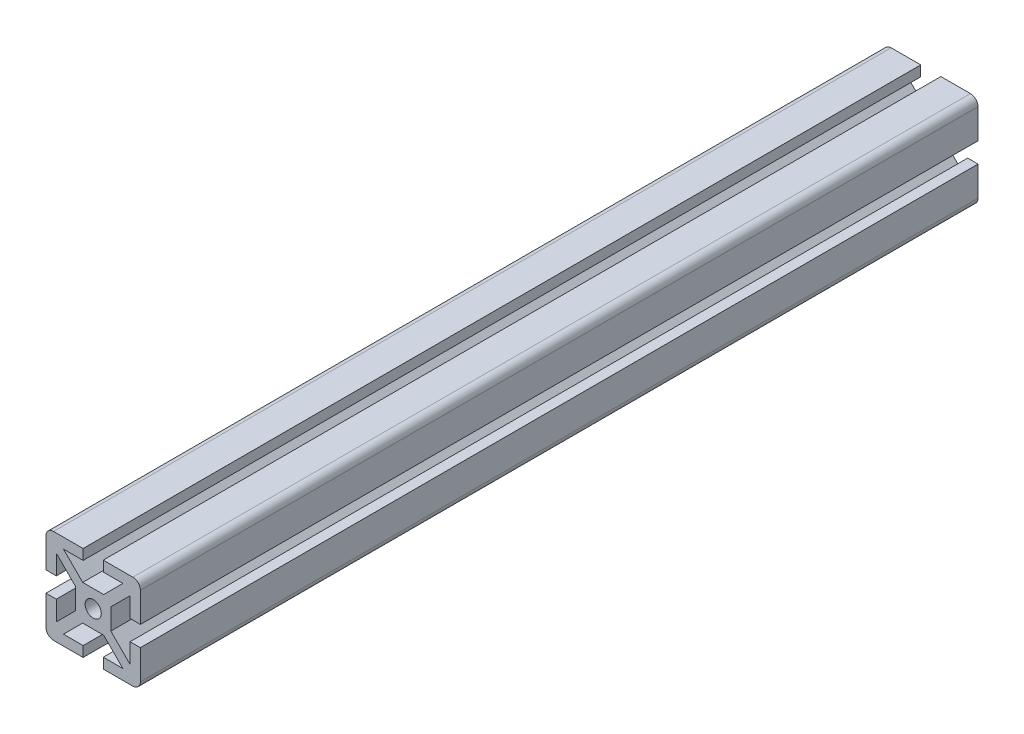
ISO-10303-21;
HEADER;
FILE_DESCRIPTION(('STEP AP214'),'2;1');
FILE_NAME('part.step','',(''),(''),'','','');
FILE_SCHEMA(('AUTOMOTIVE_DESIGN { 1 0 10303 214 1 1 1 1 }'));
ENDSEC;
DATA;
#1=APPLICATION_CONTEXT('core data for automotive mechanical design processes');
#2=APPLICATION_PROTOCOL_DEFINITION('international standard','automotive_design',2000,#1);
#3=PRODUCT_CONTEXT('',#1,'mechanical');
#4=PRODUCT('Part','Part','',(#3));
#5=PRODUCT_RELATED_PRODUCT_CATEGORY('part','',(#4));
#6=PRODUCT_DEFINITION_FORMATION('','',#4);
#7=PRODUCT_DEFINITION_CONTEXT('part definition',#1,'design');
#8=PRODUCT_DEFINITION('design','',#6,#7);
#9=PRODUCT_DEFINITION_SHAPE('','',#8);
#10=(LENGTH_UNIT() NAMED_UNIT(*) SI_UNIT(.MILLI.,.METRE.));
#11=(NAMED_UNIT(*) PLANE_ANGLE_UNIT() SI_UNIT($,.RADIAN.));
#12=(NAMED_UNIT(*) SI_UNIT($,.STERADIAN.) SOLID_ANGLE_UNIT());
#13=UNCERTAINTY_MEASURE_WITH_UNIT(LENGTH_MEASURE(1.E-05),#10,'distance_accuracy_value','');
#14=(GEOMETRIC_REPRESENTATION_CONTEXT(3) GLOBAL_UNCERTAINTY_ASSIGNED_CONTEXT((#13)) GLOBAL_UNIT_ASSIGNED_CONTEXT((#10,
#11,#12)) REPRESENTATION_CONTEXT('',''));
#15=CARTESIAN_POINT('',(0.,0.,0.));
#16=DIRECTION('',(0.,0.,1.));
#17=DIRECTION('',(1.,0.,0.));
#18=AXIS2_PLACEMENT_3D('',#15,#16,#17);
#19=CARTESIAN_POINT('',(-7.11199999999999,0.,-338.1375));
#20=DIRECTION('',(-1.,0.,0.));
#21=DIRECTION('',(0.,-1.,0.));
#22=AXIS2_PLACEMENT_3D('',#19,#20,#21);
#23=PLANE('',#22);
#24=DIRECTION('',(0.,-1.,0.));
#25=VECTOR('',#24,1.);
#26=CARTESIAN_POINT('',(-7.11199999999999,0.,0.));
#27=LINE('',#26,#25);
#28=CARTESIAN_POINT('',(-7.11199999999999,4.23831804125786,0.));
#29=VERTEX_POINT('',#28);
#30=CARTESIAN_POINT('',(-7.11199999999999,-4.23831804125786,0.));
#31=VERTEX_POINT('',#30);
#32=EDGE_CURVE('E438',#29,#31,#27,.T.);
#33=ORIENTED_EDGE('',*,*,#32,.F.);
#34=DIRECTION('',(0.,0.,1.));
#35=VECTOR('',#34,1.);
#36=CARTESIAN_POINT('',(-7.11199999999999,4.23831804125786,-338.1375));
#37=LINE('',#36,#35);
#38=CARTESIAN_POINT('',(-7.11199999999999,4.23831804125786,-338.1375));
#39=VERTEX_POINT('',#38);
#40=EDGE_CURVE('E11',#39,#29,#37,.T.);
#41=ORIENTED_EDGE('',*,*,#40,.F.);
#42=DIRECTION('',(0.,-1.,0.));
#43=VECTOR('',#42,1.);
#44=CARTESIAN_POINT('',(-7.11199999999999,0.,-338.1375));
#45=LINE('',#44,#43);
#46=CARTESIAN_POINT('',(-7.11199999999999,-4.23831804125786,-338.1375));
#47=VERTEX_POINT('',#46);
#48=EDGE_CURVE('E52',#39,#47,#45,.T.);
#49=ORIENTED_EDGE('',*,*,#48,.T.);
#50=DIRECTION('',(0.,0.,1.));
#51=VECTOR('',#50,1.);
#52=CARTESIAN_POINT('',(-7.11199999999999,-4.23831804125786,-338.1375));
#53=LINE('',#52,#51);
#54=EDGE_CURVE('E37',#47,#31,#53,.T.);
#55=ORIENTED_EDGE('',*,*,#54,.T.);
#56=EDGE_LOOP('',(#33,#41,#49,#55));
#57=FACE_BOUND('',#56,.T.);
#58=ADVANCED_FACE('F33',(#57),#23,.T.);
#59=CARTESIAN_POINT('',(-7.11199999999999,4.23831804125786,-338.1375));
#60=DIRECTION('',(-0.707106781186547,-0.707106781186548,0.));
#61=DIRECTION('',(0.707106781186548,-0.707106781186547,0.));
#62=AXIS2_PLACEMENT_3D('',#59,#60,#61);
#63=PLANE('',#62);
#64=DIRECTION('',(0.707106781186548,-0.707106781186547,0.));
#65=VECTOR('',#64,1.);
#66=CARTESIAN_POINT('',(-7.11199999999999,4.23831804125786,0.));
#67=LINE('',#66,#65);
#68=CARTESIAN_POINT('',(-14.8844,12.0107180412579,0.));
#69=VERTEX_POINT('',#68);
#70=EDGE_CURVE('E436',#69,#29,#67,.T.);
#71=ORIENTED_EDGE('',*,*,#70,.F.);
#72=DIRECTION('',(0.,0.,1.));
#73=VECTOR('',#72,1.);
#74=CARTESIAN_POINT('',(-14.8844,12.0107180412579,-338.1375));
#75=LINE('',#74,#73);
#76=CARTESIAN_POINT('',(-14.8844,12.0107180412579,-338.1375));
#77=VERTEX_POINT('',#76);
#78=EDGE_CURVE('E43',#77,#69,#75,.T.);
#79=ORIENTED_EDGE('',*,*,#78,.F.);
#80=DIRECTION('',(0.707106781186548,-0.707106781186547,0.));
#81=VECTOR('',#80,1.);
#82=CARTESIAN_POINT('',(-7.11199999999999,4.23831804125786,-338.1375));
#83=LINE('',#82,#81);
#84=EDGE_CURVE('E314',#77,#39,#83,.T.);
#85=ORIENTED_EDGE('',*,*,#84,.T.);
#86=ORIENTED_EDGE('',*,*,#40,.T.);
#87=EDGE_LOOP('',(#71,#79,#85,#86));
#88=FACE_BOUND('',#87,.T.);
#89=ADVANCED_FACE('F518',(#88),#63,.T.);
#90=CARTESIAN_POINT('',(-14.8844,12.0107180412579,-338.1375));
#91=DIRECTION('',(1.,0.,0.));
#92=DIRECTION('',(0.,1.,0.));
#93=AXIS2_PLACEMENT_3D('',#90,#91,#92);
#94=PLANE('',#93);
#95=DIRECTION('',(0.,1.,0.));
#96=VECTOR('',#95,1.);
#97=CARTESIAN_POINT('',(-14.8844,12.0107180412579,0.));
#98=LINE('',#97,#96);
#99=CARTESIAN_POINT('',(-14.8844,4.06400000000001,0.));
#100=VERTEX_POINT('',#99);
#101=EDGE_CURVE('E302',#100,#69,#98,.T.);
#102=ORIENTED_EDGE('',*,*,#101,.F.);
#103=DIRECTION('',(0.,0.,1.));
#104=VECTOR('',#103,1.);
#105=CARTESIAN_POINT('',(-14.8844,4.06400000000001,-338.1375));
#106=LINE('',#105,#104);
#107=CARTESIAN_POINT('',(-14.8844,4.06400000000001,-338.1375));
#108=VERTEX_POINT('',#107);
#109=EDGE_CURVE('E297',#108,#100,#106,.T.);
#110=ORIENTED_EDGE('',*,*,#109,.F.);
#111=DIRECTION('',(0.,1.,0.));
#112=VECTOR('',#111,1.);
#113=CARTESIAN_POINT('',(-14.8844,12.0107180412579,-338.1375));
#114=LINE('',#113,#112);
#115=EDGE_CURVE('E300',#108,#77,#114,.T.);
#116=ORIENTED_EDGE('',*,*,#115,.T.);
#117=ORIENTED_EDGE('',*,*,#78,.T.);
#118=EDGE_LOOP('',(#102,#110,#116,#117));
#119=FACE_BOUND('',#118,.T.);
#120=ADVANCED_FACE('F299',(#119),#94,.T.);
#121=CARTESIAN_POINT('',(-14.8844,4.06400000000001,-338.1375));
#122=DIRECTION('',(0.,-1.,0.));
#123=DIRECTION('',(1.,0.,0.));
#124=AXIS2_PLACEMENT_3D('',#121,#122,#123);
#125=PLANE('',#124);
#126=DIRECTION('',(1.,0.,0.));
#127=VECTOR('',#126,1.);
#128=CARTESIAN_POINT('',(-14.8844,4.06400000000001,0.));
#129=LINE('',#128,#127);
#130=CARTESIAN_POINT('',(-19.05,4.064,0.));
#131=VERTEX_POINT('',#130);
#132=EDGE_CURVE('E433',#131,#100,#129,.T.);
#133=ORIENTED_EDGE('',*,*,#132,.F.);
#134=DIRECTION('',(0.,0.,1.));
#135=VECTOR('',#134,1.);
#136=CARTESIAN_POINT('',(-19.05,4.064,-338.1375));
#137=LINE('',#136,#135);
#138=CARTESIAN_POINT('',(-19.05,4.064,-338.1375));
#139=VERTEX_POINT('',#138);
#140=EDGE_CURVE('E307',#139,#131,#137,.T.);
#141=ORIENTED_EDGE('',*,*,#140,.F.);
#142=DIRECTION('',(1.,0.,0.));
#143=VECTOR('',#142,1.);
#144=CARTESIAN_POINT('',(-14.8844,4.06400000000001,-338.1375));
#145=LINE('',#144,#143);
#146=EDGE_CURVE('E312',#139,#108,#145,.T.);
#147=ORIENTED_EDGE('',*,*,#146,.T.);
#148=ORIENTED_EDGE('',*,*,#109,.T.);
#149=EDGE_LOOP('',(#133,#141,#147,#148));
#150=FACE_BOUND('',#149,.T.);
#151=ADVANCED_FACE('F316',(#150),#125,.T.);
#152=CARTESIAN_POINT('',(-19.05,4.064,-338.1375));
#153=DIRECTION('',(-1.,0.,0.));
#154=DIRECTION('',(0.,-1.,0.));
#155=AXIS2_PLACEMENT_3D('',#152,#153,#154);
#156=PLANE('',#155);
#157=DIRECTION('',(0.,-1.,0.));
#158=VECTOR('',#157,1.);
#159=CARTESIAN_POINT('',(-19.05,4.064,0.));
#160=LINE('',#159,#158);
#161=CARTESIAN_POINT('',(-19.05,16.002,0.));
#162=VERTEX_POINT('',#161);
#163=EDGE_CURVE('E430',#162,#131,#160,.T.);
#164=ORIENTED_EDGE('',*,*,#163,.F.);
#165=DIRECTION('',(0.,0.,1.));
#166=VECTOR('',#165,1.);
#167=CARTESIAN_POINT('',(-19.05,16.002,-338.1375));
#168=LINE('',#167,#166);
#169=CARTESIAN_POINT('',(-19.05,16.002,-338.1375));
#170=VERTEX_POINT('',#169);
#171=EDGE_CURVE('E442',#170,#162,#168,.T.);
#172=ORIENTED_EDGE('',*,*,#171,.F.);
#173=DIRECTION('',(0.,-1.,0.));
#174=VECTOR('',#173,1.);
#175=CARTESIAN_POINT('',(-19.05,4.064,-338.1375));
#176=LINE('',#175,#174);
#177=EDGE_CURVE('E317',#170,#139,#176,.T.);
#178=ORIENTED_EDGE('',*,*,#177,.T.);
#179=ORIENTED_EDGE('',*,*,#140,.T.);
#180=EDGE_LOOP('',(#164,#172,#178,#179));
#181=FACE_BOUND('',#180,.T.);
#182=ADVANCED_FACE('F531',(#181),#156,.T.);
#183=CARTESIAN_POINT('',(-16.002,16.002,-338.1375));
#184=DIRECTION('',(0.,0.,1.));
#185=DIRECTION('',(1.,0.,0.));
#186=AXIS2_PLACEMENT_3D('',#183,#184,#185);
#187=CYLINDRICAL_SURFACE('',#186,3.04800000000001);
#188=CARTESIAN_POINT('',(-16.002,16.002,0.));
#189=DIRECTION('',(0.,0.,1.));
#190=DIRECTION('',(1.,0.,0.));
#191=AXIS2_PLACEMENT_3D('',#188,#189,#190);
#192=CIRCLE('',#191,3.04800000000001);
#193=CARTESIAN_POINT('',(-16.002,19.05,0.));
#194=VERTEX_POINT('',#193);
#195=EDGE_CURVE('E427',#194,#162,#192,.T.);
#196=ORIENTED_EDGE('',*,*,#195,.F.);
#197=DIRECTION('',(0.,0.,1.));
#198=VECTOR('',#197,1.);
#199=CARTESIAN_POINT('',(-16.002,19.05,-338.1375));
#200=LINE('',#199,#198);
#201=CARTESIAN_POINT('',(-16.002,19.05,-338.1375));
#202=VERTEX_POINT('',#201);
#203=EDGE_CURVE('E444',#202,#194,#200,.T.);
#204=ORIENTED_EDGE('',*,*,#203,.F.);
#205=CARTESIAN_POINT('',(-16.002,16.002,-338.1375));
#206=DIRECTION('',(0.,0.,1.));
#207=DIRECTION('',(1.,0.,0.));
#208=AXIS2_PLACEMENT_3D('',#205,#206,#207);
#209=CIRCLE('',#208,3.04800000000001);
#210=EDGE_CURVE('E319',#202,#170,#209,.T.);
#211=ORIENTED_EDGE('',*,*,#210,.T.);
#212=ORIENTED_EDGE('',*,*,#171,.T.);
#213=EDGE_LOOP('',(#196,#204,#211,#212));
#214=FACE_BOUND('',#213,.T.);
#215=ADVANCED_FACE('F534',(#214),#187,.T.);
#216=CARTESIAN_POINT('',(-4.06400000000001,19.05,-338.1375));
#217=DIRECTION('',(0.,1.,0.));
#218=DIRECTION('',(-1.,0.,0.));
#219=AXIS2_PLACEMENT_3D('',#216,#217,#218);
#220=PLANE('',#219);
#221=DIRECTION('',(-1.,0.,0.));
#222=VECTOR('',#221,1.);
#223=CARTESIAN_POINT('',(-4.06400000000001,19.05,0.));
#224=LINE('',#223,#222);
#225=CARTESIAN_POINT('',(-4.06400000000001,19.05,0.));
#226=VERTEX_POINT('',#225);
#227=EDGE_CURVE('E424',#226,#194,#224,.T.);
#228=ORIENTED_EDGE('',*,*,#227,.F.);
#229=DIRECTION('',(0.,0.,1.));
#230=VECTOR('',#229,1.);
#231=CARTESIAN_POINT('',(-4.06400000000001,19.05,-338.1375));
#232=LINE('',#231,#230);
#233=CARTESIAN_POINT('',(-4.06400000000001,19.05,-338.1375));
#234=VERTEX_POINT('',#233);
#235=EDGE_CURVE('E446',#234,#226,#232,.T.);
#236=ORIENTED_EDGE('',*,*,#235,.F.);
#237=DIRECTION('',(-1.,0.,0.));
#238=VECTOR('',#237,1.);
#239=CARTESIAN_POINT('',(-4.06400000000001,19.05,-338.1375));
#240=LINE('',#239,#238);
#241=EDGE_CURVE('E784',#234,#202,#240,.T.);
#242=ORIENTED_EDGE('',*,*,#241,.T.);
#243=ORIENTED_EDGE('',*,*,#203,.T.);
#244=EDGE_LOOP('',(#228,#236,#242,#243));
#245=FACE_BOUND('',#244,.T.);
#246=ADVANCED_FACE('F538',(#245),#220,.T.);
#247=CARTESIAN_POINT('',(-4.06400000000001,19.05,-338.1375));
#248=DIRECTION('',(1.,0.,0.));
#249=DIRECTION('',(0.,1.,0.));
#250=AXIS2_PLACEMENT_3D('',#247,#248,#249);
#251=PLANE('',#250);
#252=DIRECTION('',(0.,1.,0.));
#253=VECTOR('',#252,1.);
#254=CARTESIAN_POINT('',(-4.06400000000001,19.05,0.));
#255=LINE('',#254,#253);
#256=CARTESIAN_POINT('',(-4.064,14.8844,0.));
#257=VERTEX_POINT('',#256);
#258=EDGE_CURVE('E421',#257,#226,#255,.T.);
#259=ORIENTED_EDGE('',*,*,#258,.F.);
#260=DIRECTION('',(0.,0.,1.));
#261=VECTOR('',#260,1.);
#262=CARTESIAN_POINT('',(-4.064,14.8844,-338.1375));
#263=LINE('',#262,#261);
#264=CARTESIAN_POINT('',(-4.064,14.8844,-338.1375));
#265=VERTEX_POINT('',#264);
#266=EDGE_CURVE('E448',#265,#257,#263,.T.);
#267=ORIENTED_EDGE('',*,*,#266,.F.);
#268=DIRECTION('',(0.,1.,0.));
#269=VECTOR('',#268,1.);
#270=CARTESIAN_POINT('',(-4.06400000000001,19.05,-338.1375));
#271=LINE('',#270,#269);
#272=EDGE_CURVE('E781',#265,#234,#271,.T.);
#273=ORIENTED_EDGE('',*,*,#272,.T.);
#274=ORIENTED_EDGE('',*,*,#235,.T.);
#275=EDGE_LOOP('',(#259,#267,#273,#274));
#276=FACE_BOUND('',#275,.T.);
#277=ADVANCED_FACE('F542',(#276),#251,.T.);
#278=CARTESIAN_POINT('',(-12.0107180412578,14.8844,-338.1375));
#279=DIRECTION('',(0.,-1.,0.));
#280=DIRECTION('',(1.,0.,0.));
#281=AXIS2_PLACEMENT_3D('',#278,#279,#280);
#282=PLANE('',#281);
#283=DIRECTION('',(1.,0.,0.));
#284=VECTOR('',#283,1.);
#285=CARTESIAN_POINT('',(-12.0107180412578,14.8844,0.));
#286=LINE('',#285,#284);
#287=CARTESIAN_POINT('',(-12.0107180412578,14.8844,0.));
#288=VERTEX_POINT('',#287);
#289=EDGE_CURVE('E418',#288,#257,#286,.T.);
#290=ORIENTED_EDGE('',*,*,#289,.F.);
#291=DIRECTION('',(0.,0.,1.));
#292=VECTOR('',#291,1.);
#293=CARTESIAN_POINT('',(-12.0107180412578,14.8844,-338.1375));
#294=LINE('',#293,#292);
#295=CARTESIAN_POINT('',(-12.0107180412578,14.8844,-338.1375));
#296=VERTEX_POINT('',#295);
#297=EDGE_CURVE('E450',#296,#288,#294,.T.);
#298=ORIENTED_EDGE('',*,*,#297,.F.);
#299=DIRECTION('',(1.,0.,0.));
#300=VECTOR('',#299,1.);
#301=CARTESIAN_POINT('',(-12.0107180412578,14.8844,-338.1375));
#302=LINE('',#301,#300);
#303=EDGE_CURVE('E778',#296,#265,#302,.T.);
#304=ORIENTED_EDGE('',*,*,#303,.T.);
#305=ORIENTED_EDGE('',*,*,#266,.T.);
#306=EDGE_LOOP('',(#290,#298,#304,#305));
#307=FACE_BOUND('',#306,.T.);
#308=ADVANCED_FACE('F546',(#307),#282,.T.);
#309=CARTESIAN_POINT('',(-4.23831804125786,7.112,-338.1375));
#310=DIRECTION('',(0.707106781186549,0.707106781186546,0.));
#311=DIRECTION('',(-0.707106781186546,0.707106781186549,0.));
#312=AXIS2_PLACEMENT_3D('',#309,#310,#311);
#313=PLANE('',#312);
#314=DIRECTION('',(-0.707106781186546,0.707106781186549,0.));
#315=VECTOR('',#314,1.);
#316=CARTESIAN_POINT('',(-4.23831804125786,7.112,0.));
#317=LINE('',#316,#315);
#318=CARTESIAN_POINT('',(-4.23831804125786,7.112,0.));
#319=VERTEX_POINT('',#318);
#320=EDGE_CURVE('E415',#319,#288,#317,.T.);
#321=ORIENTED_EDGE('',*,*,#320,.F.);
#322=DIRECTION('',(0.,0.,1.));
#323=VECTOR('',#322,1.);
#324=CARTESIAN_POINT('',(-4.23831804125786,7.112,-338.1375));
#325=LINE('',#324,#323);
#326=CARTESIAN_POINT('',(-4.23831804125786,7.112,-338.1375));
#327=VERTEX_POINT('',#326);
#328=EDGE_CURVE('E452',#327,#319,#325,.T.);
#329=ORIENTED_EDGE('',*,*,#328,.F.);
#330=DIRECTION('',(-0.707106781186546,0.707106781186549,0.));
#331=VECTOR('',#330,1.);
#332=CARTESIAN_POINT('',(-4.23831804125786,7.112,-338.1375));
#333=LINE('',#332,#331);
#334=EDGE_CURVE('E775',#327,#296,#333,.T.);
#335=ORIENTED_EDGE('',*,*,#334,.T.);
#336=ORIENTED_EDGE('',*,*,#297,.T.);
#337=EDGE_LOOP('',(#321,#329,#335,#336));
#338=FACE_BOUND('',#337,.T.);
#339=ADVANCED_FACE('F550',(#338),#313,.T.);
#340=CARTESIAN_POINT('',(0.,7.112,-338.1375));
#341=DIRECTION('',(0.,1.,0.));
#342=DIRECTION('',(-1.,0.,0.));
#343=AXIS2_PLACEMENT_3D('',#340,#341,#342);
#344=PLANE('',#343);
#345=DIRECTION('',(-1.,0.,0.));
#346=VECTOR('',#345,1.);
#347=CARTESIAN_POINT('',(0.,7.112,0.));
#348=LINE('',#347,#346);
#349=CARTESIAN_POINT('',(4.23831804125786,7.112,0.));
#350=VERTEX_POINT('',#349);
#351=EDGE_CURVE('E412',#350,#319,#348,.T.);
#352=ORIENTED_EDGE('',*,*,#351,.F.);
#353=DIRECTION('',(0.,0.,1.));
#354=VECTOR('',#353,1.);
#355=CARTESIAN_POINT('',(4.23831804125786,7.112,-338.1375));
#356=LINE('',#355,#354);
#357=CARTESIAN_POINT('',(4.23831804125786,7.112,-338.1375));
#358=VERTEX_POINT('',#357);
#359=EDGE_CURVE('E454',#358,#350,#356,.T.);
#360=ORIENTED_EDGE('',*,*,#359,.F.);
#361=DIRECTION('',(-1.,0.,0.));
#362=VECTOR('',#361,1.);
#363=CARTESIAN_POINT('',(0.,7.112,-338.1375));
#364=LINE('',#363,#362);
#365=EDGE_CURVE('E773',#358,#327,#364,.T.);
#366=ORIENTED_EDGE('',*,*,#365,.T.);
#367=ORIENTED_EDGE('',*,*,#328,.T.);
#368=EDGE_LOOP('',(#352,#360,#366,#367));
#369=FACE_BOUND('',#368,.T.);
#370=ADVANCED_FACE('F554',(#369),#344,.T.);
#371=CARTESIAN_POINT('',(4.23831804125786,7.112,-338.1375));
#372=DIRECTION('',(-0.707106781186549,0.707106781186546,0.));
#373=DIRECTION('',(-0.707106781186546,-0.707106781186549,0.));
#374=AXIS2_PLACEMENT_3D('',#371,#372,#373);
#375=PLANE('',#374);
#376=DIRECTION('',(-0.707106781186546,-0.707106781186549,0.));
#377=VECTOR('',#376,1.);
#378=CARTESIAN_POINT('',(4.23831804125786,7.112,0.));
#379=LINE('',#378,#377);
#380=CARTESIAN_POINT('',(12.0107180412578,14.8844,0.));
#381=VERTEX_POINT('',#380);
#382=EDGE_CURVE('E409',#381,#350,#379,.T.);
#383=ORIENTED_EDGE('',*,*,#382,.F.);
#384=DIRECTION('',(0.,0.,1.));
#385=VECTOR('',#384,1.);
#386=CARTESIAN_POINT('',(12.0107180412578,14.8844,-338.1375));
#387=LINE('',#386,#385);
#388=CARTESIAN_POINT('',(12.0107180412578,14.8844,-338.1375));
#389=VERTEX_POINT('',#388);
#390=EDGE_CURVE('E457',#389,#381,#387,.T.);
#391=ORIENTED_EDGE('',*,*,#390,.F.);
#392=DIRECTION('',(-0.707106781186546,-0.707106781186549,0.));
#393=VECTOR('',#392,1.);
#394=CARTESIAN_POINT('',(4.23831804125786,7.112,-338.1375));
#395=LINE('',#394,#393);
#396=EDGE_CURVE('E770',#389,#358,#395,.T.);
#397=ORIENTED_EDGE('',*,*,#396,.T.);
#398=ORIENTED_EDGE('',*,*,#359,.T.);
#399=EDGE_LOOP('',(#383,#391,#397,#398));
#400=FACE_BOUND('',#399,.T.);
#401=ADVANCED_FACE('F558',(#400),#375,.T.);
#402=CARTESIAN_POINT('',(12.0107180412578,14.8844,-338.1375));
#403=DIRECTION('',(0.,-1.,0.));
#404=DIRECTION('',(1.,0.,0.));
#405=AXIS2_PLACEMENT_3D('',#402,#403,#404);
#406=PLANE('',#405);
#407=DIRECTION('',(1.,0.,0.));
#408=VECTOR('',#407,1.);
#409=CARTESIAN_POINT('',(12.0107180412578,14.8844,0.));
#410=LINE('',#409,#408);
#411=CARTESIAN_POINT('',(4.064,14.8844,0.));
#412=VERTEX_POINT('',#411);
#413=EDGE_CURVE('E406',#412,#381,#410,.T.);
#414=ORIENTED_EDGE('',*,*,#413,.F.);
#415=DIRECTION('',(0.,0.,1.));
#416=VECTOR('',#415,1.);
#417=CARTESIAN_POINT('',(4.064,14.8844,-338.1375));
#418=LINE('',#417,#416);
#419=CARTESIAN_POINT('',(4.064,14.8844,-338.1375));
#420=VERTEX_POINT('',#419);
#421=EDGE_CURVE('E459',#420,#412,#418,.T.);
#422=ORIENTED_EDGE('',*,*,#421,.F.);
#423=DIRECTION('',(1.,0.,0.));
#424=VECTOR('',#423,1.);
#425=CARTESIAN_POINT('',(12.0107180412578,14.8844,-338.1375));
#426=LINE('',#425,#424);
#427=EDGE_CURVE('E767',#420,#389,#426,.T.);
#428=ORIENTED_EDGE('',*,*,#427,.T.);
#429=ORIENTED_EDGE('',*,*,#390,.T.);
#430=EDGE_LOOP('',(#414,#422,#428,#429));
#431=FACE_BOUND('',#430,.T.);
#432=ADVANCED_FACE('F562',(#431),#406,.T.);
#433=CARTESIAN_POINT('',(4.06400000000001,19.05,-338.1375));
#434=DIRECTION('',(-1.,0.,0.));
#435=DIRECTION('',(0.,-1.,0.));
#436=AXIS2_PLACEMENT_3D('',#433,#434,#435);
#437=PLANE('',#436);
#438=DIRECTION('',(0.,-1.,0.));
#439=VECTOR('',#438,1.);
#440=CARTESIAN_POINT('',(4.06400000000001,19.05,0.));
#441=LINE('',#440,#439);
#442=CARTESIAN_POINT('',(4.06400000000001,19.05,0.));
#443=VERTEX_POINT('',#442);
#444=EDGE_CURVE('E403',#443,#412,#441,.T.);
#445=ORIENTED_EDGE('',*,*,#444,.F.);
#446=DIRECTION('',(0.,0.,1.));
#447=VECTOR('',#446,1.);
#448=CARTESIAN_POINT('',(4.06400000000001,19.05,-338.1375));
#449=LINE('',#448,#447);
#450=CARTESIAN_POINT('',(4.06400000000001,19.05,-338.1375));
#451=VERTEX_POINT('',#450);
#452=EDGE_CURVE('E461',#451,#443,#449,.T.);
#453=ORIENTED_EDGE('',*,*,#452,.F.);
#454=DIRECTION('',(0.,-1.,0.));
#455=VECTOR('',#454,1.);
#456=CARTESIAN_POINT('',(4.06400000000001,19.05,-338.1375));
#457=LINE('',#456,#455);
#458=EDGE_CURVE('E764',#451,#420,#457,.T.);
#459=ORIENTED_EDGE('',*,*,#458,.T.);
#460=ORIENTED_EDGE('',*,*,#421,.T.);
#461=EDGE_LOOP('',(#445,#453,#459,#460));
#462=FACE_BOUND('',#461,.T.);
#463=ADVANCED_FACE('F566',(#462),#437,.T.);
#464=CARTESIAN_POINT('',(4.06400000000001,19.05,-338.1375));
#465=DIRECTION('',(0.,1.,0.));
#466=DIRECTION('',(-1.,0.,0.));
#467=AXIS2_PLACEMENT_3D('',#464,#465,#466);
#468=PLANE('',#467);
#469=DIRECTION('',(-1.,0.,0.));
#470=VECTOR('',#469,1.);
#471=CARTESIAN_POINT('',(4.06400000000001,19.05,0.));
#472=LINE('',#471,#470);
#473=CARTESIAN_POINT('',(16.002,19.05,0.));
#474=VERTEX_POINT('',#473);
#475=EDGE_CURVE('E400',#474,#443,#472,.T.);
#476=ORIENTED_EDGE('',*,*,#475,.F.);
#477=DIRECTION('',(0.,0.,1.));
#478=VECTOR('',#477,1.);
#479=CARTESIAN_POINT('',(16.002,19.05,-338.1375));
#480=LINE('',#479,#478);
#481=CARTESIAN_POINT('',(16.002,19.05,-338.1375));
#482=VERTEX_POINT('',#481);
#483=EDGE_CURVE('E463',#482,#474,#480,.T.);
#484=ORIENTED_EDGE('',*,*,#483,.F.);
#485=DIRECTION('',(-1.,0.,0.));
#486=VECTOR('',#485,1.);
#487=CARTESIAN_POINT('',(4.06400000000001,19.05,-338.1375));
#488=LINE('',#487,#486);
#489=EDGE_CURVE('E761',#482,#451,#488,.T.);
#490=ORIENTED_EDGE('',*,*,#489,.T.);
#491=ORIENTED_EDGE('',*,*,#452,.T.);
#492=EDGE_LOOP('',(#476,#484,#490,#491));
#493=FACE_BOUND('',#492,.T.);
#494=ADVANCED_FACE('F570',(#493),#468,.T.);
#495=CARTESIAN_POINT('',(16.002,16.002,-338.1375));
#496=DIRECTION('',(0.,0.,1.));
#497=DIRECTION('',(1.,0.,0.));
#498=AXIS2_PLACEMENT_3D('',#495,#496,#497);
#499=CYLINDRICAL_SURFACE('',#498,3.04800000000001);
#500=CARTESIAN_POINT('',(16.002,16.002,0.));
#501=DIRECTION('',(0.,0.,1.));
#502=DIRECTION('',(-1.,0.,0.));
#503=AXIS2_PLACEMENT_3D('',#500,#501,#502);
#504=CIRCLE('',#503,3.04800000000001);
#505=CARTESIAN_POINT('',(19.05,16.002,0.));
#506=VERTEX_POINT('',#505);
#507=EDGE_CURVE('E397',#506,#474,#504,.T.);
#508=ORIENTED_EDGE('',*,*,#507,.F.);
#509=DIRECTION('',(0.,0.,1.));
#510=VECTOR('',#509,1.);
#511=CARTESIAN_POINT('',(19.05,16.002,-338.1375));
#512=LINE('',#511,#510);
#513=CARTESIAN_POINT('',(19.05,16.002,-338.1375));
#514=VERTEX_POINT('',#513);
#515=EDGE_CURVE('E465',#514,#506,#512,.T.);
#516=ORIENTED_EDGE('',*,*,#515,.F.);
#517=CARTESIAN_POINT('',(16.002,16.002,-338.1375));
#518=DIRECTION('',(0.,0.,1.));
#519=DIRECTION('',(-1.,0.,0.));
#520=AXIS2_PLACEMENT_3D('',#517,#518,#519);
#521=CIRCLE('',#520,3.04800000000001);
#522=EDGE_CURVE('E758',#514,#482,#521,.T.);
#523=ORIENTED_EDGE('',*,*,#522,.T.);
#524=ORIENTED_EDGE('',*,*,#483,.T.);
#525=EDGE_LOOP('',(#508,#516,#523,#524));
#526=FACE_BOUND('',#525,.T.);
#527=ADVANCED_FACE('F574',(#526),#499,.T.);
#528=CARTESIAN_POINT('',(19.05,4.064,-338.1375));
#529=DIRECTION('',(1.,0.,0.));
#530=DIRECTION('',(0.,1.,0.));
#531=AXIS2_PLACEMENT_3D('',#528,#529,#530);
#532=PLANE('',#531);
#533=DIRECTION('',(0.,1.,0.));
#534=VECTOR('',#533,1.);
#535=CARTESIAN_POINT('',(19.05,4.064,0.));
#536=LINE('',#535,#534);
#537=CARTESIAN_POINT('',(19.05,4.064,0.));
#538=VERTEX_POINT('',#537);
#539=EDGE_CURVE('E394',#538,#506,#536,.T.);
#540=ORIENTED_EDGE('',*,*,#539,.F.);
#541=DIRECTION('',(0.,0.,1.));
#542=VECTOR('',#541,1.);
#543=CARTESIAN_POINT('',(19.05,4.064,-338.1375));
#544=LINE('',#543,#542);
#545=CARTESIAN_POINT('',(19.05,4.064,-338.1375));
#546=VERTEX_POINT('',#545);
#547=EDGE_CURVE('E467',#546,#538,#544,.T.);
#548=ORIENTED_EDGE('',*,*,#547,.F.);
#549=DIRECTION('',(0.,1.,0.));
#550=VECTOR('',#549,1.);
#551=CARTESIAN_POINT('',(19.05,4.064,-338.1375));
#552=LINE('',#551,#550);
#553=EDGE_CURVE('E755',#546,#514,#552,.T.);
#554=ORIENTED_EDGE('',*,*,#553,.T.);
#555=ORIENTED_EDGE('',*,*,#515,.T.);
#556=EDGE_LOOP('',(#540,#548,#554,#555));
#557=FACE_BOUND('',#556,.T.);
#558=ADVANCED_FACE('F578',(#557),#532,.T.);
#559=CARTESIAN_POINT('',(14.8844,4.06400000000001,-338.1375));
#560=DIRECTION('',(0.,-1.,0.));
#561=DIRECTION('',(1.,0.,0.));
#562=AXIS2_PLACEMENT_3D('',#559,#560,#561);
#563=PLANE('',#562);
#564=DIRECTION('',(1.,0.,0.));
#565=VECTOR('',#564,1.);
#566=CARTESIAN_POINT('',(14.8844,4.06400000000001,0.));
#567=LINE('',#566,#565);
#568=CARTESIAN_POINT('',(14.8844,4.06400000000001,0.));
#569=VERTEX_POINT('',#568);
#570=EDGE_CURVE('E391',#569,#538,#567,.T.);
#571=ORIENTED_EDGE('',*,*,#570,.F.);
#572=DIRECTION('',(0.,0.,1.));
#573=VECTOR('',#572,1.);
#574=CARTESIAN_POINT('',(14.8844,4.06400000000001,-338.1375));
#575=LINE('',#574,#573);
#576=CARTESIAN_POINT('',(14.8844,4.06400000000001,-338.1375));
#577=VERTEX_POINT('',#576);
#578=EDGE_CURVE('E469',#577,#569,#575,.T.);
#579=ORIENTED_EDGE('',*,*,#578,.F.);
#580=DIRECTION('',(1.,0.,0.));
#581=VECTOR('',#580,1.);
#582=CARTESIAN_POINT('',(14.8844,4.06400000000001,-338.1375));
#583=LINE('',#582,#581);
#584=EDGE_CURVE('E752',#577,#546,#583,.T.);
#585=ORIENTED_EDGE('',*,*,#584,.T.);
#586=ORIENTED_EDGE('',*,*,#547,.T.);
#587=EDGE_LOOP('',(#571,#579,#585,#586));
#588=FACE_BOUND('',#587,.T.);
#589=ADVANCED_FACE('F582',(#588),#563,.T.);
#590=CARTESIAN_POINT('',(14.8844,12.0107180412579,-338.1375));
#591=DIRECTION('',(-1.,0.,0.));
#592=DIRECTION('',(0.,-1.,0.));
#593=AXIS2_PLACEMENT_3D('',#590,#591,#592);
#594=PLANE('',#593);
#595=DIRECTION('',(0.,-1.,0.));
#596=VECTOR('',#595,1.);
#597=CARTESIAN_POINT('',(14.8844,12.0107180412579,0.));
#598=LINE('',#597,#596);
#599=CARTESIAN_POINT('',(14.8844,12.0107180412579,0.));
#600=VERTEX_POINT('',#599);
#601=EDGE_CURVE('E388',#600,#569,#598,.T.);
#602=ORIENTED_EDGE('',*,*,#601,.F.);
#603=DIRECTION('',(0.,0.,1.));
#604=VECTOR('',#603,1.);
#605=CARTESIAN_POINT('',(14.8844,12.0107180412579,-338.1375));
#606=LINE('',#605,#604);
#607=CARTESIAN_POINT('',(14.8844,12.0107180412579,-338.1375));
#608=VERTEX_POINT('',#607);
#609=EDGE_CURVE('E471',#608,#600,#606,.T.);
#610=ORIENTED_EDGE('',*,*,#609,.F.);
#611=DIRECTION('',(0.,-1.,0.));
#612=VECTOR('',#611,1.);
#613=CARTESIAN_POINT('',(14.8844,12.0107180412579,-338.1375));
#614=LINE('',#613,#612);
#615=EDGE_CURVE('E744',#608,#577,#614,.T.);
#616=ORIENTED_EDGE('',*,*,#615,.T.);
#617=ORIENTED_EDGE('',*,*,#578,.T.);
#618=EDGE_LOOP('',(#602,#610,#616,#617));
#619=FACE_BOUND('',#618,.T.);
#620=ADVANCED_FACE('F586',(#619),#594,.T.);
#621=CARTESIAN_POINT('',(7.11199999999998,4.23831804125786,-338.1375));
#622=DIRECTION('',(0.707106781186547,-0.707106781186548,0.));
#623=DIRECTION('',(0.707106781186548,0.707106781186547,0.));
#624=AXIS2_PLACEMENT_3D('',#621,#622,#623);
#625=PLANE('',#624);
#626=DIRECTION('',(0.707106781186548,0.707106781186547,0.));
#627=VECTOR('',#626,1.);
#628=CARTESIAN_POINT('',(7.11199999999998,4.23831804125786,0.));
#629=LINE('',#628,#627);
#630=CARTESIAN_POINT('',(7.11199999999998,4.23831804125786,0.));
#631=VERTEX_POINT('',#630);
#632=EDGE_CURVE('E385',#631,#600,#629,.T.);
#633=ORIENTED_EDGE('',*,*,#632,.F.);
#634=DIRECTION('',(0.,0.,1.));
#635=VECTOR('',#634,1.);
#636=CARTESIAN_POINT('',(7.11199999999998,4.23831804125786,-338.1375));
#637=LINE('',#636,#635);
#638=CARTESIAN_POINT('',(7.11199999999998,4.23831804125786,-338.1375));
#639=VERTEX_POINT('',#638);
#640=EDGE_CURVE('E473',#639,#631,#637,.T.);
#641=ORIENTED_EDGE('',*,*,#640,.F.);
#642=DIRECTION('',(0.707106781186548,0.707106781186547,0.));
#643=VECTOR('',#642,1.);
#644=CARTESIAN_POINT('',(7.11199999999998,4.23831804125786,-338.1375));
#645=LINE('',#644,#643);
#646=EDGE_CURVE('E742',#639,#608,#645,.T.);
#647=ORIENTED_EDGE('',*,*,#646,.T.);
#648=ORIENTED_EDGE('',*,*,#609,.T.);
#649=EDGE_LOOP('',(#633,#641,#647,#648));
#650=FACE_BOUND('',#649,.T.);
#651=ADVANCED_FACE('F590',(#650),#625,.T.);
#652=CARTESIAN_POINT('',(7.11199999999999,0.,-338.1375));
#653=DIRECTION('',(1.,0.,0.));
#654=DIRECTION('',(0.,1.,0.));
#655=AXIS2_PLACEMENT_3D('',#652,#653,#654);
#656=PLANE('',#655);
#657=DIRECTION('',(0.,1.,0.));
#658=VECTOR('',#657,1.);
#659=CARTESIAN_POINT('',(7.11199999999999,0.,0.));
#660=LINE('',#659,#658);
#661=CARTESIAN_POINT('',(7.11199999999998,-4.23831804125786,0.));
#662=VERTEX_POINT('',#661);
#663=EDGE_CURVE('E382',#662,#631,#660,.T.);
#664=ORIENTED_EDGE('',*,*,#663,.F.);
#665=DIRECTION('',(0.,0.,1.));
#666=VECTOR('',#665,1.);
#667=CARTESIAN_POINT('',(7.11199999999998,-4.23831804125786,-338.1375));
#668=LINE('',#667,#666);
#669=CARTESIAN_POINT('',(7.11199999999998,-4.23831804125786,-338.1375));
#670=VERTEX_POINT('',#669);
#671=EDGE_CURVE('E475',#670,#662,#668,.T.);
#672=ORIENTED_EDGE('',*,*,#671,.F.);
#673=DIRECTION('',(0.,1.,0.));
#674=VECTOR('',#673,1.);
#675=CARTESIAN_POINT('',(7.11199999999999,0.,-338.1375));
#676=LINE('',#675,#674);
#677=EDGE_CURVE('E737',#670,#639,#676,.T.);
#678=ORIENTED_EDGE('',*,*,#677,.T.);
#679=ORIENTED_EDGE('',*,*,#640,.T.);
#680=EDGE_LOOP('',(#664,#672,#678,#679));
#681=FACE_BOUND('',#680,.T.);
#682=ADVANCED_FACE('F594',(#681),#656,.T.);
#683=CARTESIAN_POINT('',(7.11199999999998,-4.23831804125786,-338.1375));
#684=DIRECTION('',(0.707106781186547,0.707106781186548,0.));
#685=DIRECTION('',(-0.707106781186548,0.707106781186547,0.));
#686=AXIS2_PLACEMENT_3D('',#683,#684,#685);
#687=PLANE('',#686);
#688=DIRECTION('',(-0.707106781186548,0.707106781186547,0.));
#689=VECTOR('',#688,1.);
#690=CARTESIAN_POINT('',(7.11199999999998,-4.23831804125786,0.));
#691=LINE('',#690,#689);
#692=CARTESIAN_POINT('',(14.8844,-12.0107180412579,0.));
#693=VERTEX_POINT('',#692);
#694=EDGE_CURVE('E379',#693,#662,#691,.T.);
#695=ORIENTED_EDGE('',*,*,#694,.F.);
#696=DIRECTION('',(0.,0.,1.));
#697=VECTOR('',#696,1.);
#698=CARTESIAN_POINT('',(14.8844,-12.0107180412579,-338.1375));
#699=LINE('',#698,#697);
#700=CARTESIAN_POINT('',(14.8844,-12.0107180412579,-338.1375));
#701=VERTEX_POINT('',#700);
#702=EDGE_CURVE('E478',#701,#693,#699,.T.);
#703=ORIENTED_EDGE('',*,*,#702,.F.);
#704=DIRECTION('',(-0.707106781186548,0.707106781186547,0.));
#705=VECTOR('',#704,1.);
#706=CARTESIAN_POINT('',(7.11199999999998,-4.23831804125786,-338.1375));
#707=LINE('',#706,#705);
#708=EDGE_CURVE('E735',#701,#670,#707,.T.);
#709=ORIENTED_EDGE('',*,*,#708,.T.);
#710=ORIENTED_EDGE('',*,*,#671,.T.);
#711=EDGE_LOOP('',(#695,#703,#709,#710));
#712=FACE_BOUND('',#711,.T.);
#713=ADVANCED_FACE('F598',(#712),#687,.T.);
#714=CARTESIAN_POINT('',(14.8844,-12.0107180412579,-338.1375));
#715=DIRECTION('',(-1.,0.,0.));
#716=DIRECTION('',(0.,-1.,0.));
#717=AXIS2_PLACEMENT_3D('',#714,#715,#716);
#718=PLANE('',#717);
#719=DIRECTION('',(0.,-1.,0.));
#720=VECTOR('',#719,1.);
#721=CARTESIAN_POINT('',(14.8844,-12.0107180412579,0.));
#722=LINE('',#721,#720);
#723=CARTESIAN_POINT('',(14.8844,-4.06400000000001,0.));
#724=VERTEX_POINT('',#723);
#725=EDGE_CURVE('E376',#724,#693,#722,.T.);
#726=ORIENTED_EDGE('',*,*,#725,.F.);
#727=DIRECTION('',(0.,0.,1.));
#728=VECTOR('',#727,1.);
#729=CARTESIAN_POINT('',(14.8844,-4.06400000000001,-338.1375));
#730=LINE('',#729,#728);
#731=CARTESIAN_POINT('',(14.8844,-4.06400000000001,-338.1375));
#732=VERTEX_POINT('',#731);
#733=EDGE_CURVE('E480',#732,#724,#730,.T.);
#734=ORIENTED_EDGE('',*,*,#733,.F.);
#735=DIRECTION('',(0.,-1.,0.));
#736=VECTOR('',#735,1.);
#737=CARTESIAN_POINT('',(14.8844,-12.0107180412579,-338.1375));
#738=LINE('',#737,#736);
#739=EDGE_CURVE('E746',#732,#701,#738,.T.);
#740=ORIENTED_EDGE('',*,*,#739,.T.);
#741=ORIENTED_EDGE('',*,*,#702,.T.);
#742=EDGE_LOOP('',(#726,#734,#740,#741));
#743=FACE_BOUND('',#742,.T.);
#744=ADVANCED_FACE('F602',(#743),#718,.T.);
#745=CARTESIAN_POINT('',(14.8844,-4.06400000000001,-338.1375));
#746=DIRECTION('',(0.,1.,0.));
#747=DIRECTION('',(-1.,0.,0.));
#748=AXIS2_PLACEMENT_3D('',#745,#746,#747);
#749=PLANE('',#748);
#750=DIRECTION('',(-1.,0.,0.));
#751=VECTOR('',#750,1.);
#752=CARTESIAN_POINT('',(14.8844,-4.06400000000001,0.));
#753=LINE('',#752,#751);
#754=CARTESIAN_POINT('',(19.05,-4.06399999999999,0.));
#755=VERTEX_POINT('',#754);
#756=EDGE_CURVE('E373',#755,#724,#753,.T.);
#757=ORIENTED_EDGE('',*,*,#756,.F.);
#758=DIRECTION('',(0.,0.,1.));
#759=VECTOR('',#758,1.);
#760=CARTESIAN_POINT('',(19.05,-4.06399999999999,-338.1375));
#761=LINE('',#760,#759);
#762=CARTESIAN_POINT('',(19.05,-4.06399999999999,-338.1375));
#763=VERTEX_POINT('',#762);
#764=EDGE_CURVE('E482',#763,#755,#761,.T.);
#765=ORIENTED_EDGE('',*,*,#764,.F.);
#766=DIRECTION('',(-1.,0.,0.));
#767=VECTOR('',#766,1.);
#768=CARTESIAN_POINT('',(14.8844,-4.06400000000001,-338.1375));
#769=LINE('',#768,#767);
#770=EDGE_CURVE('E729',#763,#732,#769,.T.);
#771=ORIENTED_EDGE('',*,*,#770,.T.);
#772=ORIENTED_EDGE('',*,*,#733,.T.);
#773=EDGE_LOOP('',(#757,#765,#771,#772));
#774=FACE_BOUND('',#773,.T.);
#775=ADVANCED_FACE('F606',(#774),#749,.T.);
#776=CARTESIAN_POINT('',(19.05,-4.06399999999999,-338.1375));
#777=DIRECTION('',(1.,0.,0.));
#778=DIRECTION('',(0.,0.,-1.));
#779=AXIS2_PLACEMENT_3D('',#776,#777,#778);
#780=PLANE('',#779);
#781=DIRECTION('',(0.,1.,0.));
#782=VECTOR('',#781,1.);
#783=CARTESIAN_POINT('',(19.05,-4.06399999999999,0.));
#784=LINE('',#783,#782);
#785=CARTESIAN_POINT('',(19.05,-16.002,0.));
#786=VERTEX_POINT('',#785);
#787=EDGE_CURVE('E370',#786,#755,#784,.T.);
#788=ORIENTED_EDGE('',*,*,#787,.F.);
#789=DIRECTION('',(0.,0.,1.));
#790=VECTOR('',#789,1.);
#791=CARTESIAN_POINT('',(19.05,-16.002,-338.1375));
#792=LINE('',#791,#790);
#793=CARTESIAN_POINT('',(19.05,-16.002,-338.1375));
#794=VERTEX_POINT('',#793);
#795=EDGE_CURVE('E484',#794,#786,#792,.T.);
#796=ORIENTED_EDGE('',*,*,#795,.F.);
#797=DIRECTION('',(0.,1.,0.));
#798=VECTOR('',#797,1.);
#799=CARTESIAN_POINT('',(19.05,-4.06399999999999,-338.1375));
#800=LINE('',#799,#798);
#801=EDGE_CURVE('E725',#794,#763,#800,.T.);
#802=ORIENTED_EDGE('',*,*,#801,.T.);
#803=ORIENTED_EDGE('',*,*,#764,.T.);
#804=EDGE_LOOP('',(#788,#796,#802,#803));
#805=FACE_BOUND('',#804,.T.);
#806=ADVANCED_FACE('F610',(#805),#780,.T.);
#807=CARTESIAN_POINT('',(16.002,-16.002,-338.1375));
#808=DIRECTION('',(0.,0.,1.));
#809=DIRECTION('',(1.,0.,0.));
#810=AXIS2_PLACEMENT_3D('',#807,#808,#809);
#811=CYLINDRICAL_SURFACE('',#810,3.04800000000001);
#812=CARTESIAN_POINT('',(16.002,-16.002,0.));
#813=DIRECTION('',(0.,0.,1.));
#814=DIRECTION('',(1.,0.,0.));
#815=AXIS2_PLACEMENT_3D('',#812,#813,#814);
#816=CIRCLE('',#815,3.04800000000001);
#817=CARTESIAN_POINT('',(16.002,-19.05,0.));
#818=VERTEX_POINT('',#817);
#819=EDGE_CURVE('E367',#818,#786,#816,.T.);
#820=ORIENTED_EDGE('',*,*,#819,.F.);
#821=DIRECTION('',(0.,0.,1.));
#822=VECTOR('',#821,1.);
#823=CARTESIAN_POINT('',(16.002,-19.05,-338.1375));
#824=LINE('',#823,#822);
#825=CARTESIAN_POINT('',(16.002,-19.05,-338.1375));
#826=VERTEX_POINT('',#825);
#827=EDGE_CURVE('E486',#826,#818,#824,.T.);
#828=ORIENTED_EDGE('',*,*,#827,.F.);
#829=CARTESIAN_POINT('',(16.002,-16.002,-338.1375));
#830=DIRECTION('',(0.,0.,1.));
#831=DIRECTION('',(1.,0.,0.));
#832=AXIS2_PLACEMENT_3D('',#829,#830,#831);
#833=CIRCLE('',#832,3.04800000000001);
#834=EDGE_CURVE('E819',#826,#794,#833,.T.);
#835=ORIENTED_EDGE('',*,*,#834,.T.);
#836=ORIENTED_EDGE('',*,*,#795,.T.);
#837=EDGE_LOOP('',(#820,#828,#835,#836));
#838=FACE_BOUND('',#837,.T.);
#839=ADVANCED_FACE('F614',(#838),#811,.T.);
#840=CARTESIAN_POINT('',(4.06400000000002,-19.05,-338.1375));
#841=DIRECTION('',(0.,-1.,0.));
#842=DIRECTION('',(1.,0.,0.));
#843=AXIS2_PLACEMENT_3D('',#840,#841,#842);
#844=PLANE('',#843);
#845=DIRECTION('',(1.,0.,0.));
#846=VECTOR('',#845,1.);
#847=CARTESIAN_POINT('',(4.06400000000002,-19.05,0.));
#848=LINE('',#847,#846);
#849=CARTESIAN_POINT('',(4.06400000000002,-19.05,0.));
#850=VERTEX_POINT('',#849);
#851=EDGE_CURVE('E364',#850,#818,#848,.T.);
#852=ORIENTED_EDGE('',*,*,#851,.F.);
#853=DIRECTION('',(0.,0.,1.));
#854=VECTOR('',#853,1.);
#855=CARTESIAN_POINT('',(4.06400000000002,-19.05,-338.1375));
#856=LINE('',#855,#854);
#857=CARTESIAN_POINT('',(4.06400000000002,-19.05,-338.1375));
#858=VERTEX_POINT('',#857);
#859=EDGE_CURVE('E488',#858,#850,#856,.T.);
#860=ORIENTED_EDGE('',*,*,#859,.F.);
#861=DIRECTION('',(1.,0.,0.));
#862=VECTOR('',#861,1.);
#863=CARTESIAN_POINT('',(4.06400000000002,-19.05,-338.1375));
#864=LINE('',#863,#862);
#865=EDGE_CURVE('E718',#858,#826,#864,.T.);
#866=ORIENTED_EDGE('',*,*,#865,.T.);
#867=ORIENTED_EDGE('',*,*,#827,.T.);
#868=EDGE_LOOP('',(#852,#860,#866,#867));
#869=FACE_BOUND('',#868,.T.);
#870=ADVANCED_FACE('F618',(#869),#844,.T.);
#871=CARTESIAN_POINT('',(4.06400000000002,-19.05,-338.1375));
#872=DIRECTION('',(-1.,0.,0.));
#873=DIRECTION('',(0.,-1.,0.));
#874=AXIS2_PLACEMENT_3D('',#871,#872,#873);
#875=PLANE('',#874);
#876=DIRECTION('',(0.,-1.,0.));
#877=VECTOR('',#876,1.);
#878=CARTESIAN_POINT('',(4.06400000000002,-19.05,0.));
#879=LINE('',#878,#877);
#880=CARTESIAN_POINT('',(4.06400000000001,-14.8844,0.));
#881=VERTEX_POINT('',#880);
#882=EDGE_CURVE('E361',#881,#850,#879,.T.);
#883=ORIENTED_EDGE('',*,*,#882,.F.);
#884=DIRECTION('',(0.,0.,1.));
#885=VECTOR('',#884,1.);
#886=CARTESIAN_POINT('',(4.06400000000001,-14.8844,-338.1375));
#887=LINE('',#886,#885);
#888=CARTESIAN_POINT('',(4.06400000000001,-14.8844,-338.1375));
#889=VERTEX_POINT('',#888);
#890=EDGE_CURVE('E490',#889,#881,#887,.T.);
#891=ORIENTED_EDGE('',*,*,#890,.F.);
#892=DIRECTION('',(0.,-1.,0.));
#893=VECTOR('',#892,1.);
#894=CARTESIAN_POINT('',(4.06400000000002,-19.05,-338.1375));
#895=LINE('',#894,#893);
#896=EDGE_CURVE('E714',#889,#858,#895,.T.);
#897=ORIENTED_EDGE('',*,*,#896,.T.);
#898=ORIENTED_EDGE('',*,*,#859,.T.);
#899=EDGE_LOOP('',(#883,#891,#897,#898));
#900=FACE_BOUND('',#899,.T.);
#901=ADVANCED_FACE('F622',(#900),#875,.T.);
#902=CARTESIAN_POINT('',(12.0107180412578,-14.8844,-338.1375));
#903=DIRECTION('',(0.,1.,0.));
#904=DIRECTION('',(-1.,0.,0.));
#905=AXIS2_PLACEMENT_3D('',#902,#903,#904);
#906=PLANE('',#905);
#907=DIRECTION('',(-1.,0.,0.));
#908=VECTOR('',#907,1.);
#909=CARTESIAN_POINT('',(12.0107180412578,-14.8844,0.));
#910=LINE('',#909,#908);
#911=CARTESIAN_POINT('',(12.0107180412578,-14.8844,0.));
#912=VERTEX_POINT('',#911);
#913=EDGE_CURVE('E358',#912,#881,#910,.T.);
#914=ORIENTED_EDGE('',*,*,#913,.F.);
#915=DIRECTION('',(0.,0.,1.));
#916=VECTOR('',#915,1.);
#917=CARTESIAN_POINT('',(12.0107180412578,-14.8844,-338.1375));
#918=LINE('',#917,#916);
#919=CARTESIAN_POINT('',(12.0107180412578,-14.8844,-338.1375));
#920=VERTEX_POINT('',#919);
#921=EDGE_CURVE('E492',#920,#912,#918,.T.);
#922=ORIENTED_EDGE('',*,*,#921,.F.);
#923=DIRECTION('',(-1.,0.,0.));
#924=VECTOR('',#923,1.);
#925=CARTESIAN_POINT('',(12.0107180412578,-14.8844,-338.1375));
#926=LINE('',#925,#924);
#927=EDGE_CURVE('E823',#920,#889,#926,.T.);
#928=ORIENTED_EDGE('',*,*,#927,.T.);
#929=ORIENTED_EDGE('',*,*,#890,.T.);
#930=EDGE_LOOP('',(#914,#922,#928,#929));
#931=FACE_BOUND('',#930,.T.);
#932=ADVANCED_FACE('F626',(#931),#906,.T.);
#933=CARTESIAN_POINT('',(4.23831804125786,-7.112,-338.1375));
#934=DIRECTION('',(-0.707106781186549,-0.707106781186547,0.));
#935=DIRECTION('',(0.707106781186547,-0.707106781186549,0.));
#936=AXIS2_PLACEMENT_3D('',#933,#934,#935);
#937=PLANE('',#936);
#938=DIRECTION('',(0.707106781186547,-0.707106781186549,0.));
#939=VECTOR('',#938,1.);
#940=CARTESIAN_POINT('',(4.23831804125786,-7.112,0.));
#941=LINE('',#940,#939);
#942=CARTESIAN_POINT('',(4.23831804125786,-7.112,0.));
#943=VERTEX_POINT('',#942);
#944=EDGE_CURVE('E355',#943,#912,#941,.T.);
#945=ORIENTED_EDGE('',*,*,#944,.F.);
#946=DIRECTION('',(0.,0.,1.));
#947=VECTOR('',#946,1.);
#948=CARTESIAN_POINT('',(4.23831804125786,-7.112,-338.1375));
#949=LINE('',#948,#947);
#950=CARTESIAN_POINT('',(4.23831804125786,-7.112,-338.1375));
#951=VERTEX_POINT('',#950);
#952=EDGE_CURVE('E494',#951,#943,#949,.T.);
#953=ORIENTED_EDGE('',*,*,#952,.F.);
#954=DIRECTION('',(0.707106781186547,-0.707106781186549,0.));
#955=VECTOR('',#954,1.);
#956=CARTESIAN_POINT('',(4.23831804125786,-7.112,-338.1375));
#957=LINE('',#956,#955);
#958=EDGE_CURVE('E707',#951,#920,#957,.T.);
#959=ORIENTED_EDGE('',*,*,#958,.T.);
#960=ORIENTED_EDGE('',*,*,#921,.T.);
#961=EDGE_LOOP('',(#945,#953,#959,#960));
#962=FACE_BOUND('',#961,.T.);
#963=ADVANCED_FACE('F630',(#962),#937,.T.);
#964=CARTESIAN_POINT('',(4.23831804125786,-7.112,-338.1375));
#965=DIRECTION('',(0.,-1.,0.));
#966=DIRECTION('',(1.,0.,0.));
#967=AXIS2_PLACEMENT_3D('',#964,#965,#966);
#968=PLANE('',#967);
#969=DIRECTION('',(1.,0.,0.));
#970=VECTOR('',#969,1.);
#971=CARTESIAN_POINT('',(4.23831804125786,-7.112,0.));
#972=LINE('',#971,#970);
#973=CARTESIAN_POINT('',(-4.23831804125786,-7.112,0.));
#974=VERTEX_POINT('',#973);
#975=EDGE_CURVE('E352',#974,#943,#972,.T.);
#976=ORIENTED_EDGE('',*,*,#975,.F.);
#977=DIRECTION('',(0.,0.,1.));
#978=VECTOR('',#977,1.);
#979=CARTESIAN_POINT('',(-4.23831804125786,-7.112,-338.1375));
#980=LINE('',#979,#978);
#981=CARTESIAN_POINT('',(-4.23831804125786,-7.112,-338.1375));
#982=VERTEX_POINT('',#981);
#983=EDGE_CURVE('E496',#982,#974,#980,.T.);
#984=ORIENTED_EDGE('',*,*,#983,.F.);
#985=DIRECTION('',(1.,0.,0.));
#986=VECTOR('',#985,1.);
#987=CARTESIAN_POINT('',(0.,-7.112,-338.1375));
#988=LINE('',#987,#986);
#989=EDGE_CURVE('E703',#982,#951,#988,.T.);
#990=ORIENTED_EDGE('',*,*,#989,.T.);
#991=ORIENTED_EDGE('',*,*,#952,.T.);
#992=EDGE_LOOP('',(#976,#984,#990,#991));
#993=FACE_BOUND('',#992,.T.);
#994=ADVANCED_FACE('F634',(#993),#968,.T.);
#995=CARTESIAN_POINT('',(-4.23831804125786,-7.112,-338.1375));
#996=DIRECTION('',(0.707106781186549,-0.707106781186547,0.));
#997=DIRECTION('',(0.707106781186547,0.707106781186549,0.));
#998=AXIS2_PLACEMENT_3D('',#995,#996,#997);
#999=PLANE('',#998);
#1000=DIRECTION('',(0.707106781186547,0.707106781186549,0.));
#1001=VECTOR('',#1000,1.);
#1002=CARTESIAN_POINT('',(-4.23831804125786,-7.112,0.));
#1003=LINE('',#1002,#1001);
#1004=CARTESIAN_POINT('',(-12.0107180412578,-14.8844,0.));
#1005=VERTEX_POINT('',#1004);
#1006=EDGE_CURVE('E349',#1005,#974,#1003,.T.);
#1007=ORIENTED_EDGE('',*,*,#1006,.F.);
#1008=DIRECTION('',(0.,0.,1.));
#1009=VECTOR('',#1008,1.);
#1010=CARTESIAN_POINT('',(-12.0107180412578,-14.8844,-338.1375));
#1011=LINE('',#1010,#1009);
#1012=CARTESIAN_POINT('',(-12.0107180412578,-14.8844,-338.1375));
#1013=VERTEX_POINT('',#1012);
#1014=EDGE_CURVE('E499',#1013,#1005,#1011,.T.);
#1015=ORIENTED_EDGE('',*,*,#1014,.F.);
#1016=DIRECTION('',(0.707106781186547,0.707106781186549,0.));
#1017=VECTOR('',#1016,1.);
#1018=CARTESIAN_POINT('',(-4.23831804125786,-7.112,-338.1375));
#1019=LINE('',#1018,#1017);
#1020=EDGE_CURVE('E827',#1013,#982,#1019,.T.);
#1021=ORIENTED_EDGE('',*,*,#1020,.T.);
#1022=ORIENTED_EDGE('',*,*,#983,.T.);
#1023=EDGE_LOOP('',(#1007,#1015,#1021,#1022));
#1024=FACE_BOUND('',#1023,.T.);
#1025=ADVANCED_FACE('F638',(#1024),#999,.T.);
#1026=CARTESIAN_POINT('',(-12.0107180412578,-14.8844,-338.1375));
#1027=DIRECTION('',(0.,1.,0.));
#1028=DIRECTION('',(-1.,0.,0.));
#1029=AXIS2_PLACEMENT_3D('',#1026,#1027,#1028);
#1030=PLANE('',#1029);
#1031=DIRECTION('',(-1.,0.,0.));
#1032=VECTOR('',#1031,1.);
#1033=CARTESIAN_POINT('',(-12.0107180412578,-14.8844,0.));
#1034=LINE('',#1033,#1032);
#1035=CARTESIAN_POINT('',(-4.06400000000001,-14.8844,0.));
#1036=VERTEX_POINT('',#1035);
#1037=EDGE_CURVE('E346',#1036,#1005,#1034,.T.);
#1038=ORIENTED_EDGE('',*,*,#1037,.F.);
#1039=DIRECTION('',(0.,0.,1.));
#1040=VECTOR('',#1039,1.);
#1041=CARTESIAN_POINT('',(-4.06400000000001,-14.8844,-338.1375));
#1042=LINE('',#1041,#1040);
#1043=CARTESIAN_POINT('',(-4.06400000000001,-14.8844,-338.1375));
#1044=VERTEX_POINT('',#1043);
#1045=EDGE_CURVE('E501',#1044,#1036,#1042,.T.);
#1046=ORIENTED_EDGE('',*,*,#1045,.F.);
#1047=DIRECTION('',(-1.,0.,0.));
#1048=VECTOR('',#1047,1.);
#1049=CARTESIAN_POINT('',(-12.0107180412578,-14.8844,-338.1375));
#1050=LINE('',#1049,#1048);
#1051=EDGE_CURVE('E697',#1044,#1013,#1050,.T.);
#1052=ORIENTED_EDGE('',*,*,#1051,.T.);
#1053=ORIENTED_EDGE('',*,*,#1014,.T.);
#1054=EDGE_LOOP('',(#1038,#1046,#1052,#1053));
#1055=FACE_BOUND('',#1054,.T.);
#1056=ADVANCED_FACE('F642',(#1055),#1030,.T.);
#1057=CARTESIAN_POINT('',(-4.06400000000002,-19.05,-338.1375));
#1058=DIRECTION('',(1.,0.,0.));
#1059=DIRECTION('',(0.,1.,0.));
#1060=AXIS2_PLACEMENT_3D('',#1057,#1058,#1059);
#1061=PLANE('',#1060);
#1062=DIRECTION('',(0.,1.,0.));
#1063=VECTOR('',#1062,1.);
#1064=CARTESIAN_POINT('',(-4.06400000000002,-19.05,0.));
#1065=LINE('',#1064,#1063);
#1066=CARTESIAN_POINT('',(-4.06400000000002,-19.05,0.));
#1067=VERTEX_POINT('',#1066);
#1068=EDGE_CURVE('E343',#1067,#1036,#1065,.T.);
#1069=ORIENTED_EDGE('',*,*,#1068,.F.);
#1070=DIRECTION('',(0.,0.,1.));
#1071=VECTOR('',#1070,1.);
#1072=CARTESIAN_POINT('',(-4.06400000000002,-19.05,-338.1375));
#1073=LINE('',#1072,#1071);
#1074=CARTESIAN_POINT('',(-4.06400000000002,-19.05,-338.1375));
#1075=VERTEX_POINT('',#1074);
#1076=EDGE_CURVE('E503',#1075,#1067,#1073,.T.);
#1077=ORIENTED_EDGE('',*,*,#1076,.F.);
#1078=DIRECTION('',(0.,1.,0.));
#1079=VECTOR('',#1078,1.);
#1080=CARTESIAN_POINT('',(-4.06400000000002,-19.05,-338.1375));
#1081=LINE('',#1080,#1079);
#1082=EDGE_CURVE('E693',#1075,#1044,#1081,.T.);
#1083=ORIENTED_EDGE('',*,*,#1082,.T.);
#1084=ORIENTED_EDGE('',*,*,#1045,.T.);
#1085=EDGE_LOOP('',(#1069,#1077,#1083,#1084));
#1086=FACE_BOUND('',#1085,.T.);
#1087=ADVANCED_FACE('F646',(#1086),#1061,.T.);
#1088=CARTESIAN_POINT('',(-4.06400000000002,-19.05,-338.1375));
#1089=DIRECTION('',(0.,-1.,0.));
#1090=DIRECTION('',(1.,0.,0.));
#1091=AXIS2_PLACEMENT_3D('',#1088,#1089,#1090);
#1092=PLANE('',#1091);
#1093=DIRECTION('',(1.,0.,0.));
#1094=VECTOR('',#1093,1.);
#1095=CARTESIAN_POINT('',(-4.06400000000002,-19.05,0.));
#1096=LINE('',#1095,#1094);
#1097=CARTESIAN_POINT('',(-16.002,-19.05,0.));
#1098=VERTEX_POINT('',#1097);
#1099=EDGE_CURVE('E340',#1098,#1067,#1096,.T.);
#1100=ORIENTED_EDGE('',*,*,#1099,.F.);
#1101=DIRECTION('',(0.,0.,1.));
#1102=VECTOR('',#1101,1.);
#1103=CARTESIAN_POINT('',(-16.002,-19.05,-338.1375));
#1104=LINE('',#1103,#1102);
#1105=CARTESIAN_POINT('',(-16.002,-19.05,-338.1375));
#1106=VERTEX_POINT('',#1105);
#1107=EDGE_CURVE('E505',#1106,#1098,#1104,.T.);
#1108=ORIENTED_EDGE('',*,*,#1107,.F.);
#1109=DIRECTION('',(1.,0.,0.));
#1110=VECTOR('',#1109,1.);
#1111=CARTESIAN_POINT('',(-4.06400000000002,-19.05,-338.1375));
#1112=LINE('',#1111,#1110);
#1113=EDGE_CURVE('E831',#1106,#1075,#1112,.T.);
#1114=ORIENTED_EDGE('',*,*,#1113,.T.);
#1115=ORIENTED_EDGE('',*,*,#1076,.T.);
#1116=EDGE_LOOP('',(#1100,#1108,#1114,#1115));
#1117=FACE_BOUND('',#1116,.T.);
#1118=ADVANCED_FACE('F650',(#1117),#1092,.T.);
#1119=CARTESIAN_POINT('',(-16.002,-16.002,-338.1375));
#1120=DIRECTION('',(0.,0.,1.));
#1121=DIRECTION('',(1.,0.,0.));
#1122=AXIS2_PLACEMENT_3D('',#1119,#1120,#1121);
#1123=CYLINDRICAL_SURFACE('',#1122,3.04800000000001);
#1124=CARTESIAN_POINT('',(-16.002,-16.002,0.));
#1125=DIRECTION('',(0.,0.,1.));
#1126=DIRECTION('',(-1.,0.,0.));
#1127=AXIS2_PLACEMENT_3D('',#1124,#1125,#1126);
#1128=CIRCLE('',#1127,3.04800000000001);
#1129=CARTESIAN_POINT('',(-19.05,-16.002,0.));
#1130=VERTEX_POINT('',#1129);
#1131=EDGE_CURVE('E337',#1130,#1098,#1128,.T.);
#1132=ORIENTED_EDGE('',*,*,#1131,.F.);
#1133=DIRECTION('',(0.,0.,1.));
#1134=VECTOR('',#1133,1.);
#1135=CARTESIAN_POINT('',(-19.05,-16.002,-338.1375));
#1136=LINE('',#1135,#1134);
#1137=CARTESIAN_POINT('',(-19.05,-16.002,-338.1375));
#1138=VERTEX_POINT('',#1137);
#1139=EDGE_CURVE('E507',#1138,#1130,#1136,.T.);
#1140=ORIENTED_EDGE('',*,*,#1139,.F.);
#1141=CARTESIAN_POINT('',(-16.002,-16.002,-338.1375));
#1142=DIRECTION('',(0.,0.,1.));
#1143=DIRECTION('',(-1.,0.,0.));
#1144=AXIS2_PLACEMENT_3D('',#1141,#1142,#1143);
#1145=CIRCLE('',#1144,3.04800000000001);
#1146=EDGE_CURVE('E686',#1138,#1106,#1145,.T.);
#1147=ORIENTED_EDGE('',*,*,#1146,.T.);
#1148=ORIENTED_EDGE('',*,*,#1107,.T.);
#1149=EDGE_LOOP('',(#1132,#1140,#1147,#1148));
#1150=FACE_BOUND('',#1149,.T.);
#1151=ADVANCED_FACE('F654',(#1150),#1123,.T.);
#1152=CARTESIAN_POINT('',(-19.05,-4.06399999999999,-338.1375));
#1153=DIRECTION('',(-1.,0.,0.));
#1154=DIRECTION('',(0.,0.,1.));
#1155=AXIS2_PLACEMENT_3D('',#1152,#1153,#1154);
#1156=PLANE('',#1155);
#1157=DIRECTION('',(0.,-1.,0.));
#1158=VECTOR('',#1157,1.);
#1159=CARTESIAN_POINT('',(-19.05,-4.06399999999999,0.));
#1160=LINE('',#1159,#1158);
#1161=CARTESIAN_POINT('',(-19.05,-4.06399999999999,0.));
#1162=VERTEX_POINT('',#1161);
#1163=EDGE_CURVE('E334',#1162,#1130,#1160,.T.);
#1164=ORIENTED_EDGE('',*,*,#1163,.F.);
#1165=DIRECTION('',(0.,0.,1.));
#1166=VECTOR('',#1165,1.);
#1167=CARTESIAN_POINT('',(-19.05,-4.06399999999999,-338.1375));
#1168=LINE('',#1167,#1166);
#1169=CARTESIAN_POINT('',(-19.05,-4.06399999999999,-338.1375));
#1170=VERTEX_POINT('',#1169);
#1171=EDGE_CURVE('E509',#1170,#1162,#1168,.T.);
#1172=ORIENTED_EDGE('',*,*,#1171,.F.);
#1173=DIRECTION('',(0.,-1.,0.));
#1174=VECTOR('',#1173,1.);
#1175=CARTESIAN_POINT('',(-19.05,-4.06399999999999,-338.1375));
#1176=LINE('',#1175,#1174);
#1177=EDGE_CURVE('E682',#1170,#1138,#1176,.T.);
#1178=ORIENTED_EDGE('',*,*,#1177,.T.);
#1179=ORIENTED_EDGE('',*,*,#1139,.T.);
#1180=EDGE_LOOP('',(#1164,#1172,#1178,#1179));
#1181=FACE_BOUND('',#1180,.T.);
#1182=ADVANCED_FACE('F658',(#1181),#1156,.T.);
#1183=CARTESIAN_POINT('',(-14.8844,-4.06400000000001,-338.1375));
#1184=DIRECTION('',(0.,1.,0.));
#1185=DIRECTION('',(-1.,0.,0.));
#1186=AXIS2_PLACEMENT_3D('',#1183,#1184,#1185);
#1187=PLANE('',#1186);
#1188=DIRECTION('',(-1.,0.,0.));
#1189=VECTOR('',#1188,1.);
#1190=CARTESIAN_POINT('',(-14.8844,-4.06400000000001,0.));
#1191=LINE('',#1190,#1189);
#1192=CARTESIAN_POINT('',(-14.8844,-4.06400000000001,0.));
#1193=VERTEX_POINT('',#1192);
#1194=EDGE_CURVE('E331',#1193,#1162,#1191,.T.);
#1195=ORIENTED_EDGE('',*,*,#1194,.F.);
#1196=DIRECTION('',(0.,0.,1.));
#1197=VECTOR('',#1196,1.);
#1198=CARTESIAN_POINT('',(-14.8844,-4.06400000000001,-338.1375));
#1199=LINE('',#1198,#1197);
#1200=CARTESIAN_POINT('',(-14.8844,-4.06400000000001,-338.1375));
#1201=VERTEX_POINT('',#1200);
#1202=EDGE_CURVE('E511',#1201,#1193,#1199,.T.);
#1203=ORIENTED_EDGE('',*,*,#1202,.F.);
#1204=DIRECTION('',(-1.,0.,0.));
#1205=VECTOR('',#1204,1.);
#1206=CARTESIAN_POINT('',(-14.8844,-4.06400000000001,-338.1375));
#1207=LINE('',#1206,#1205);
#1208=EDGE_CURVE('E835',#1201,#1170,#1207,.T.);
#1209=ORIENTED_EDGE('',*,*,#1208,.T.);
#1210=ORIENTED_EDGE('',*,*,#1171,.T.);
#1211=EDGE_LOOP('',(#1195,#1203,#1209,#1210));
#1212=FACE_BOUND('',#1211,.T.);
#1213=ADVANCED_FACE('F662',(#1212),#1187,.T.);
#1214=CARTESIAN_POINT('',(-14.8844,-12.0107180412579,-338.1375));
#1215=DIRECTION('',(1.,0.,0.));
#1216=DIRECTION('',(0.,1.,0.));
#1217=AXIS2_PLACEMENT_3D('',#1214,#1215,#1216);
#1218=PLANE('',#1217);
#1219=DIRECTION('',(0.,1.,0.));
#1220=VECTOR('',#1219,1.);
#1221=CARTESIAN_POINT('',(-14.8844,-12.0107180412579,0.));
#1222=LINE('',#1221,#1220);
#1223=CARTESIAN_POINT('',(-14.8844,-12.0107180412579,0.));
#1224=VERTEX_POINT('',#1223);
#1225=EDGE_CURVE('E327',#1224,#1193,#1222,.T.);
#1226=ORIENTED_EDGE('',*,*,#1225,.F.);
#1227=DIRECTION('',(0.,0.,1.));
#1228=VECTOR('',#1227,1.);
#1229=CARTESIAN_POINT('',(-14.8844,-12.0107180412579,-338.1375));
#1230=LINE('',#1229,#1228);
#1231=CARTESIAN_POINT('',(-14.8844,-12.0107180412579,-338.1375));
#1232=VERTEX_POINT('',#1231);
#1233=EDGE_CURVE('E512',#1232,#1224,#1230,.T.);
#1234=ORIENTED_EDGE('',*,*,#1233,.F.);
#1235=DIRECTION('',(0.,1.,0.));
#1236=VECTOR('',#1235,1.);
#1237=CARTESIAN_POINT('',(-14.8844,-12.0107180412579,-338.1375));
#1238=LINE('',#1237,#1236);
#1239=EDGE_CURVE('E675',#1232,#1201,#1238,.T.);
#1240=ORIENTED_EDGE('',*,*,#1239,.T.);
#1241=ORIENTED_EDGE('',*,*,#1202,.T.);
#1242=EDGE_LOOP('',(#1226,#1234,#1240,#1241));
#1243=FACE_BOUND('',#1242,.T.);
#1244=ADVANCED_FACE('F665',(#1243),#1218,.T.);
#1245=CARTESIAN_POINT('',(-7.11199999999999,-4.23831804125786,-338.1375));
#1246=DIRECTION('',(-0.707106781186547,0.707106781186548,0.));
#1247=DIRECTION('',(-0.707106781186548,-0.707106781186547,0.));
#1248=AXIS2_PLACEMENT_3D('',#1245,#1246,#1247);
#1249=PLANE('',#1248);
#1250=DIRECTION('',(-0.707106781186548,-0.707106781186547,0.));
#1251=VECTOR('',#1250,1.);
#1252=CARTESIAN_POINT('',(-7.11199999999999,-4.23831804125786,0.));
#1253=LINE('',#1252,#1251);
#1254=EDGE_CURVE('E324',#31,#1224,#1253,.T.);
#1255=ORIENTED_EDGE('',*,*,#1254,.F.);
#1256=ORIENTED_EDGE('',*,*,#54,.F.);
#1257=DIRECTION('',(-0.707106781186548,-0.707106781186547,0.));
#1258=VECTOR('',#1257,1.);
#1259=CARTESIAN_POINT('',(-7.11199999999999,-4.23831804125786,-338.1375));
#1260=LINE('',#1259,#1258);
#1261=EDGE_CURVE('E838',#47,#1232,#1260,.T.);
#1262=ORIENTED_EDGE('',*,*,#1261,.T.);
#1263=ORIENTED_EDGE('',*,*,#1233,.T.);
#1264=EDGE_LOOP('',(#1255,#1256,#1262,#1263));
#1265=FACE_BOUND('',#1264,.T.);
#1266=ADVANCED_FACE('F35',(#1265),#1249,.T.);
#1267=CARTESIAN_POINT('',(-16.002,-16.002,-338.1375));
#1268=DIRECTION('',(0.,0.,-1.));
#1269=DIRECTION('',(-1.,0.,0.));
#1270=AXIS2_PLACEMENT_3D('',#1267,#1268,#1269);
#1271=PLANE('',#1270);
#1272=CARTESIAN_POINT('',(0.,0.,-338.1375));
#1273=DIRECTION('',(0.,0.,1.));
#1274=DIRECTION('',(1.,0.,0.));
#1275=AXIS2_PLACEMENT_3D('',#1272,#1273,#1274);
#1276=CIRCLE('',#1275,3.2639);
#1277=CARTESIAN_POINT('',(3.2639,0.,-338.1375));
#1278=VERTEX_POINT('',#1277);
#1279=EDGE_CURVE('E328',#1278,#1278,#1276,.T.);
#1280=ORIENTED_EDGE('',*,*,#1279,.T.);
#1281=EDGE_LOOP('',(#1280));
#1282=FACE_BOUND('',#1281,.T.);
#1283=ORIENTED_EDGE('',*,*,#48,.F.);
#1284=ORIENTED_EDGE('',*,*,#84,.F.);
#1285=ORIENTED_EDGE('',*,*,#115,.F.);
#1286=ORIENTED_EDGE('',*,*,#146,.F.);
#1287=ORIENTED_EDGE('',*,*,#177,.F.);
#1288=ORIENTED_EDGE('',*,*,#210,.F.);
#1289=ORIENTED_EDGE('',*,*,#241,.F.);
#1290=ORIENTED_EDGE('',*,*,#272,.F.);
#1291=ORIENTED_EDGE('',*,*,#303,.F.);
#1292=ORIENTED_EDGE('',*,*,#334,.F.);
#1293=ORIENTED_EDGE('',*,*,#365,.F.);
#1294=ORIENTED_EDGE('',*,*,#396,.F.);
#1295=ORIENTED_EDGE('',*,*,#427,.F.);
#1296=ORIENTED_EDGE('',*,*,#458,.F.);
#1297=ORIENTED_EDGE('',*,*,#489,.F.);
#1298=ORIENTED_EDGE('',*,*,#522,.F.);
#1299=ORIENTED_EDGE('',*,*,#553,.F.);
#1300=ORIENTED_EDGE('',*,*,#584,.F.);
#1301=ORIENTED_EDGE('',*,*,#615,.F.);
#1302=ORIENTED_EDGE('',*,*,#646,.F.);
#1303=ORIENTED_EDGE('',*,*,#677,.F.);
#1304=ORIENTED_EDGE('',*,*,#708,.F.);
#1305=ORIENTED_EDGE('',*,*,#739,.F.);
#1306=ORIENTED_EDGE('',*,*,#770,.F.);
#1307=ORIENTED_EDGE('',*,*,#801,.F.);
#1308=ORIENTED_EDGE('',*,*,#834,.F.);
#1309=ORIENTED_EDGE('',*,*,#865,.F.);
#1310=ORIENTED_EDGE('',*,*,#896,.F.);
#1311=ORIENTED_EDGE('',*,*,#927,.F.);
#1312=ORIENTED_EDGE('',*,*,#958,.F.);
#1313=ORIENTED_EDGE('',*,*,#989,.F.);
#1314=ORIENTED_EDGE('',*,*,#1020,.F.);
#1315=ORIENTED_EDGE('',*,*,#1051,.F.);
#1316=ORIENTED_EDGE('',*,*,#1082,.F.);
#1317=ORIENTED_EDGE('',*,*,#1113,.F.);
#1318=ORIENTED_EDGE('',*,*,#1146,.F.);
#1319=ORIENTED_EDGE('',*,*,#1177,.F.);
#1320=ORIENTED_EDGE('',*,*,#1208,.F.);
#1321=ORIENTED_EDGE('',*,*,#1239,.F.);
#1322=ORIENTED_EDGE('',*,*,#1261,.F.);
#1323=EDGE_LOOP('',(#1283,#1284,#1285,#1286,#1287,#1288,#1289,#1290,#1291,#1292,#1293,#1294,
#1295,#1296,#1297,#1298,#1299,#1300,#1301,#1302,#1303,#1304,#1305,#1306,#1307,#1308,#1309,#1310,
#1311,#1312,#1313,#1314,#1315,#1316,#1317,#1318,#1319,#1320,#1321,#1322));
#1324=FACE_BOUND('',#1323,.T.);
#1325=ADVANCED_FACE('F310',(#1282,#1324),#1271,.T.);
#1326=CARTESIAN_POINT('',(-16.002,-16.002,0.));
#1327=DIRECTION('',(0.,0.,-1.));
#1328=DIRECTION('',(-1.,0.,0.));
#1329=AXIS2_PLACEMENT_3D('',#1326,#1327,#1328);
#1330=PLANE('',#1329);
#1331=CARTESIAN_POINT('',(0.,0.,0.));
#1332=DIRECTION('',(0.,0.,1.));
#1333=DIRECTION('',(1.,0.,0.));
#1334=AXIS2_PLACEMENT_3D('',#1331,#1332,#1333);
#1335=CIRCLE('',#1334,3.2639);
#1336=CARTESIAN_POINT('',(3.2639,0.,0.));
#1337=VERTEX_POINT('',#1336);
#1338=EDGE_CURVE('E841',#1337,#1337,#1335,.T.);
#1339=ORIENTED_EDGE('',*,*,#1338,.F.);
#1340=EDGE_LOOP('',(#1339));
#1341=FACE_BOUND('',#1340,.T.);
#1342=ORIENTED_EDGE('',*,*,#32,.T.);
#1343=ORIENTED_EDGE('',*,*,#1254,.T.);
#1344=ORIENTED_EDGE('',*,*,#1225,.T.);
#1345=ORIENTED_EDGE('',*,*,#1194,.T.);
#1346=ORIENTED_EDGE('',*,*,#1163,.T.);
#1347=ORIENTED_EDGE('',*,*,#1131,.T.);
#1348=ORIENTED_EDGE('',*,*,#1099,.T.);
#1349=ORIENTED_EDGE('',*,*,#1068,.T.);
#1350=ORIENTED_EDGE('',*,*,#1037,.T.);
#1351=ORIENTED_EDGE('',*,*,#1006,.T.);
#1352=ORIENTED_EDGE('',*,*,#975,.T.);
#1353=ORIENTED_EDGE('',*,*,#944,.T.);
#1354=ORIENTED_EDGE('',*,*,#913,.T.);
#1355=ORIENTED_EDGE('',*,*,#882,.T.);
#1356=ORIENTED_EDGE('',*,*,#851,.T.);
#1357=ORIENTED_EDGE('',*,*,#819,.T.);
#1358=ORIENTED_EDGE('',*,*,#787,.T.);
#1359=ORIENTED_EDGE('',*,*,#756,.T.);
#1360=ORIENTED_EDGE('',*,*,#725,.T.);
#1361=ORIENTED_EDGE('',*,*,#694,.T.);
#1362=ORIENTED_EDGE('',*,*,#663,.T.);
#1363=ORIENTED_EDGE('',*,*,#632,.T.);
#1364=ORIENTED_EDGE('',*,*,#601,.T.);
#1365=ORIENTED_EDGE('',*,*,#570,.T.);
#1366=ORIENTED_EDGE('',*,*,#539,.T.);
#1367=ORIENTED_EDGE('',*,*,#507,.T.);
#1368=ORIENTED_EDGE('',*,*,#475,.T.);
#1369=ORIENTED_EDGE('',*,*,#444,.T.);
#1370=ORIENTED_EDGE('',*,*,#413,.T.);
#1371=ORIENTED_EDGE('',*,*,#382,.T.);
#1372=ORIENTED_EDGE('',*,*,#351,.T.);
#1373=ORIENTED_EDGE('',*,*,#320,.T.);
#1374=ORIENTED_EDGE('',*,*,#289,.T.);
#1375=ORIENTED_EDGE('',*,*,#258,.T.);
#1376=ORIENTED_EDGE('',*,*,#227,.T.);
#1377=ORIENTED_EDGE('',*,*,#195,.T.);
#1378=ORIENTED_EDGE('',*,*,#163,.T.);
#1379=ORIENTED_EDGE('',*,*,#132,.T.);
#1380=ORIENTED_EDGE('',*,*,#101,.T.);
#1381=ORIENTED_EDGE('',*,*,#70,.T.);
#1382=EDGE_LOOP('',(#1342,#1343,#1344,#1345,#1346,#1347,#1348,#1349,#1350,#1351,#1352,#1353,
#1354,#1355,#1356,#1357,#1358,#1359,#1360,#1361,#1362,#1363,#1364,#1365,#1366,#1367,#1368,#1369,
#1370,#1371,#1372,#1373,#1374,#1375,#1376,#1377,#1378,#1379,#1380,#1381));
#1383=FACE_BOUND('',#1382,.T.);
#1384=ADVANCED_FACE('F517',(#1341,#1383),#1330,.F.);
#1385=CARTESIAN_POINT('',(0.,0.,-338.1375));
#1386=DIRECTION('',(0.,0.,1.));
#1387=DIRECTION('',(1.,0.,0.));
#1388=AXIS2_PLACEMENT_3D('',#1385,#1386,#1387);
#1389=CYLINDRICAL_SURFACE('',#1388,3.2639);
#1390=CARTESIAN_POINT('',(3.2639,0.,-338.1375));
#1391=CARTESIAN_POINT('',(3.2639,0.,-334.615234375));
#1392=CARTESIAN_POINT('',(3.2639,0.,-331.09296875));
#1393=CARTESIAN_POINT('',(3.2639,0.,-324.0484375));
#1394=CARTESIAN_POINT('',(3.2639,0.,-320.526171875));
#1395=CARTESIAN_POINT('',(3.2639,0.,-313.481640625));
#1396=CARTESIAN_POINT('',(3.2639,0.,-309.959375));
#1397=CARTESIAN_POINT('',(3.2639,0.,-302.91484375));
#1398=CARTESIAN_POINT('',(3.2639,0.,-299.392578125));
#1399=CARTESIAN_POINT('',(3.2639,0.,-292.348046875));
#1400=CARTESIAN_POINT('',(3.2639,0.,-288.82578125));
#1401=CARTESIAN_POINT('',(3.2639,0.,-281.78125));
#1402=CARTESIAN_POINT('',(3.2639,0.,-278.258984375));
#1403=CARTESIAN_POINT('',(3.2639,0.,-271.214453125));
#1404=CARTESIAN_POINT('',(3.2639,0.,-267.6921875));
#1405=CARTESIAN_POINT('',(3.2639,0.,-260.64765625));
#1406=CARTESIAN_POINT('',(3.2639,0.,-257.125390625));
#1407=CARTESIAN_POINT('',(3.2639,0.,-250.080859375));
#1408=CARTESIAN_POINT('',(3.2639,0.,-246.55859375));
#1409=CARTESIAN_POINT('',(3.2639,0.,-239.5140625));
#1410=CARTESIAN_POINT('',(3.2639,0.,-235.991796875));
#1411=CARTESIAN_POINT('',(3.2639,0.,-228.947265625));
#1412=CARTESIAN_POINT('',(3.2639,0.,-225.425));
#1413=CARTESIAN_POINT('',(3.2639,0.,-218.38046875));
#1414=CARTESIAN_POINT('',(3.2639,0.,-214.858203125));
#1415=CARTESIAN_POINT('',(3.2639,0.,-207.813671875));
#1416=CARTESIAN_POINT('',(3.2639,0.,-204.29140625));
#1417=CARTESIAN_POINT('',(3.2639,0.,-197.246875));
#1418=CARTESIAN_POINT('',(3.2639,0.,-193.724609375));
#1419=CARTESIAN_POINT('',(3.2639,0.,-186.680078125));
#1420=CARTESIAN_POINT('',(3.2639,0.,-183.1578125));
#1421=CARTESIAN_POINT('',(3.2639,0.,-176.11328125));
#1422=CARTESIAN_POINT('',(3.2639,0.,-172.591015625));
#1423=CARTESIAN_POINT('',(3.2639,0.,-165.546484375));
#1424=CARTESIAN_POINT('',(3.2639,0.,-162.02421875));
#1425=CARTESIAN_POINT('',(3.2639,0.,-154.9796875));
#1426=CARTESIAN_POINT('',(3.2639,0.,-151.457421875));
#1427=CARTESIAN_POINT('',(3.2639,0.,-144.412890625));
#1428=CARTESIAN_POINT('',(3.2639,0.,-140.890625));
#1429=CARTESIAN_POINT('',(3.2639,0.,-133.84609375));
#1430=CARTESIAN_POINT('',(3.2639,0.,-130.323828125));
#1431=CARTESIAN_POINT('',(3.2639,0.,-123.279296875));
#1432=CARTESIAN_POINT('',(3.2639,0.,-119.75703125));
#1433=CARTESIAN_POINT('',(3.2639,0.,-112.7125));
#1434=CARTESIAN_POINT('',(3.2639,0.,-109.190234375));
#1435=CARTESIAN_POINT('',(3.2639,0.,-102.145703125));
#1436=CARTESIAN_POINT('',(3.2639,0.,-98.6234375));
#1437=CARTESIAN_POINT('',(3.2639,0.,-91.57890625));
#1438=CARTESIAN_POINT('',(3.2639,0.,-88.056640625));
#1439=CARTESIAN_POINT('',(3.2639,0.,-81.012109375));
#1440=CARTESIAN_POINT('',(3.2639,0.,-77.48984375));
#1441=CARTESIAN_POINT('',(3.2639,0.,-70.4453125));
#1442=CARTESIAN_POINT('',(3.2639,0.,-66.923046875));
#1443=CARTESIAN_POINT('',(3.2639,0.,-59.8785156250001));
#1444=CARTESIAN_POINT('',(3.2639,0.,-56.3562500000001));
#1445=CARTESIAN_POINT('',(3.2639,0.,-49.3117187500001));
#1446=CARTESIAN_POINT('',(3.2639,0.,-45.7894531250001));
#1447=CARTESIAN_POINT('',(3.2639,0.,-38.7449218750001));
#1448=CARTESIAN_POINT('',(3.2639,0.,-35.2226562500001));
#1449=CARTESIAN_POINT('',(3.2639,0.,-28.1781250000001));
#1450=CARTESIAN_POINT('',(3.2639,0.,-24.6558593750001));
#1451=CARTESIAN_POINT('',(3.2639,0.,-17.6113281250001));
#1452=CARTESIAN_POINT('',(3.2639,0.,-14.0890625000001));
#1453=CARTESIAN_POINT('',(3.2639,0.,-7.04453125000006));
#1454=CARTESIAN_POINT('',(3.2639,0.,-3.52226562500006));
#1455=CARTESIAN_POINT('',(3.2639,0.,0.));
#1456=B_SPLINE_CURVE_WITH_KNOTS('',3,(#1390,#1391,#1392,#1393,#1394,#1395,#1396,#1397,#1398,
#1399,#1400,#1401,#1402,#1403,#1404,#1405,#1406,#1407,#1408,#1409,#1410,#1411,#1412,#1413,#1414,
#1415,#1416,#1417,#1418,#1419,#1420,#1421,#1422,#1423,#1424,#1425,#1426,#1427,#1428,#1429,#1430,
#1431,#1432,#1433,#1434,#1435,#1436,#1437,#1438,#1439,#1440,#1441,#1442,#1443,#1444,#1445,#1446,
#1447,#1448,#1449,#1450,#1451,#1452,#1453,#1454,#1455),.UNSPECIFIED.,.F.,.F.,(4,2,2,2,2,2,2,2,2,
2,2,2,2,2,2,2,2,2,2,2,2,2,2,2,2,2,2,2,2,2,2,2,4),(0.,10.566796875,21.13359375,31.700390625,
42.2671875,52.833984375,63.40078125,73.967578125,84.534375,95.101171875,105.66796875,
116.234765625,126.8015625,137.368359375,147.93515625,158.501953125,169.06875,179.635546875,
190.20234375,200.769140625,211.3359375,221.902734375,232.46953125,243.036328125,253.603125,
264.169921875,274.73671875,285.303515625,295.8703125,306.437109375,317.00390625,327.570703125,
338.1375),.UNSPECIFIED.);
#1457=EDGE_CURVE('BSEAM848',#1278,#1337,#1456,.T.);
#1458=ORIENTED_EDGE('',*,*,#1279,.F.);
#1459=ORIENTED_EDGE('',*,*,#1338,.T.);
#1460=ORIENTED_EDGE('',*,*,#1457,.T.);
#1461=ORIENTED_EDGE('',*,*,#1457,.F.);
#1462=EDGE_LOOP('',(#1458,#1460,#1459,#1461));
#1463=FACE_BOUND('',#1462,.T.);
#1464=ADVANCED_FACE('F848',(#1463),#1389,.F.);
#1465=CLOSED_SHELL('',(#58,#89,#120,#151,#182,#215,#246,#277,#308,#339,#370,#401,#432,#463,#494,
#527,#558,#589,#620,#651,#682,#713,#744,#775,#806,#839,#870,#901,#932,#963,#994,#1025,#1056,
#1087,#1118,#1151,#1182,#1213,#1244,#1266,#1325,#1384,#1464));
#1466=MANIFOLD_SOLID_BREP('B2',#1465);
#1467=ADVANCED_BREP_SHAPE_REPRESENTATION('',(#18,#1466),#14);
#1468=SHAPE_DEFINITION_REPRESENTATION(#9,#1467);
ENDSEC;
END-ISO-10303-21;
